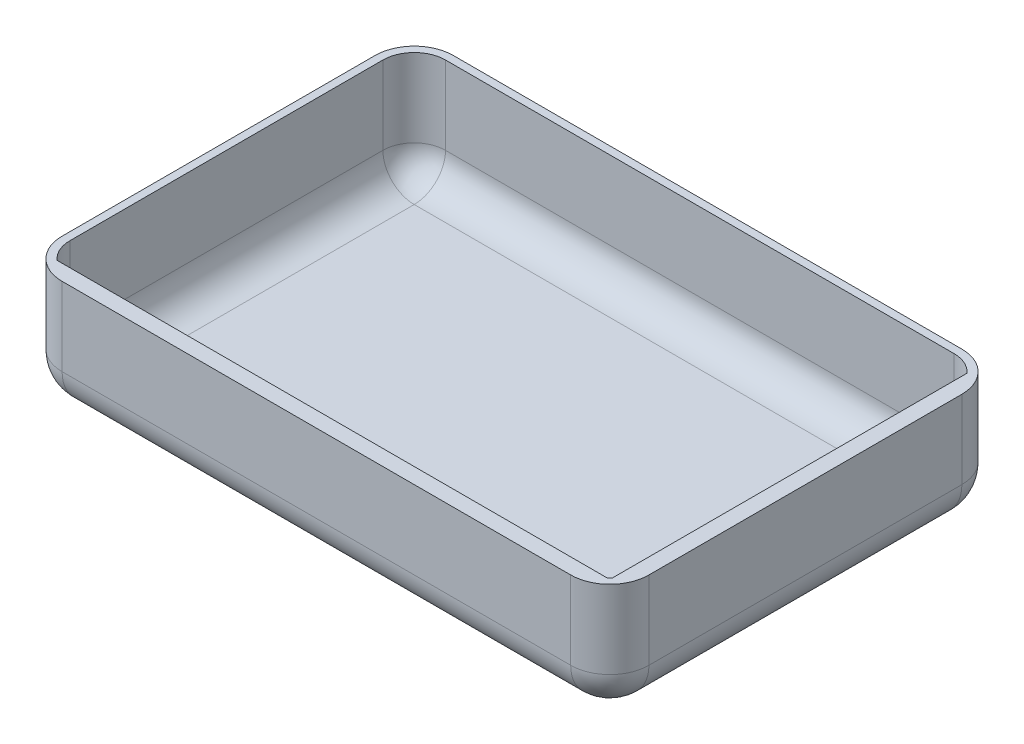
ISO-10303-21;
HEADER;
FILE_DESCRIPTION(('STEP AP214'),'2;1');
FILE_NAME('part.step','',(''),(''),'','','');
FILE_SCHEMA(('AUTOMOTIVE_DESIGN { 1 0 10303 214 1 1 1 1 }'));
ENDSEC;
DATA;
#1=APPLICATION_CONTEXT('core data for automotive mechanical design processes');
#2=APPLICATION_PROTOCOL_DEFINITION('international standard','automotive_design',2000,#1);
#3=PRODUCT_CONTEXT('',#1,'mechanical');
#4=PRODUCT('Part','Part','',(#3));
#5=PRODUCT_RELATED_PRODUCT_CATEGORY('part','',(#4));
#6=PRODUCT_DEFINITION_FORMATION('','',#4);
#7=PRODUCT_DEFINITION_CONTEXT('part definition',#1,'design');
#8=PRODUCT_DEFINITION('design','',#6,#7);
#9=PRODUCT_DEFINITION_SHAPE('','',#8);
#10=(LENGTH_UNIT() NAMED_UNIT(*) SI_UNIT(.MILLI.,.METRE.));
#11=(NAMED_UNIT(*) PLANE_ANGLE_UNIT() SI_UNIT($,.RADIAN.));
#12=(NAMED_UNIT(*) SI_UNIT($,.STERADIAN.) SOLID_ANGLE_UNIT());
#13=UNCERTAINTY_MEASURE_WITH_UNIT(LENGTH_MEASURE(1.E-05),#10,'distance_accuracy_value','');
#14=(GEOMETRIC_REPRESENTATION_CONTEXT(3) GLOBAL_UNCERTAINTY_ASSIGNED_CONTEXT((#13)) GLOBAL_UNIT_ASSIGNED_CONTEXT((#10,
#11,#12)) REPRESENTATION_CONTEXT('',''));
#15=CARTESIAN_POINT('',(0.,0.,0.));
#16=DIRECTION('',(0.,0.,1.));
#17=DIRECTION('',(1.,0.,0.));
#18=AXIS2_PLACEMENT_3D('',#15,#16,#17);
#19=CARTESIAN_POINT('',(-75.,30.,-50.));
#20=DIRECTION('',(1.,0.,0.));
#21=DIRECTION('',(0.,0.,-1.));
#22=AXIS2_PLACEMENT_3D('',#19,#20,#21);
#23=PLANE('',#22);
#24=DIRECTION('',(0.,0.,1.));
#25=VECTOR('',#24,1.);
#26=CARTESIAN_POINT('',(-75.,30.,-50.));
#27=LINE('',#26,#25);
#28=CARTESIAN_POINT('',(-75.,30.,-40.));
#29=VERTEX_POINT('',#28);
#30=CARTESIAN_POINT('',(-75.,30.,40.));
#31=VERTEX_POINT('',#30);
#32=EDGE_CURVE('E305',#29,#31,#27,.T.);
#33=ORIENTED_EDGE('',*,*,#32,.F.);
#34=DIRECTION('',(0.,-1.,0.));
#35=VECTOR('',#34,1.);
#36=CARTESIAN_POINT('',(-75.,30.,-40.));
#37=LINE('',#36,#35);
#38=CARTESIAN_POINT('',(-75.,10.,-40.));
#39=VERTEX_POINT('',#38);
#40=EDGE_CURVE('E59',#29,#39,#37,.T.);
#41=ORIENTED_EDGE('',*,*,#40,.T.);
#42=DIRECTION('',(0.,0.,1.));
#43=VECTOR('',#42,1.);
#44=CARTESIAN_POINT('',(-75.,10.,-50.));
#45=LINE('',#44,#43);
#46=CARTESIAN_POINT('',(-75.,10.,40.));
#47=VERTEX_POINT('',#46);
#48=EDGE_CURVE('E347',#39,#47,#45,.T.);
#49=ORIENTED_EDGE('',*,*,#48,.T.);
#50=DIRECTION('',(0.,-1.,0.));
#51=VECTOR('',#50,1.);
#52=CARTESIAN_POINT('',(-75.,30.,40.));
#53=LINE('',#52,#51);
#54=EDGE_CURVE('E345',#47,#31,#53,.F.);
#55=ORIENTED_EDGE('',*,*,#54,.T.);
#56=EDGE_LOOP('',(#33,#41,#49,#55));
#57=FACE_BOUND('',#56,.T.);
#58=ADVANCED_FACE('F34',(#57),#23,.F.);
#59=CARTESIAN_POINT('',(-75.,30.,50.));
#60=DIRECTION('',(0.,0.,-1.));
#61=DIRECTION('',(-1.,0.,0.));
#62=AXIS2_PLACEMENT_3D('',#59,#60,#61);
#63=PLANE('',#62);
#64=DIRECTION('',(1.,0.,0.));
#65=VECTOR('',#64,1.);
#66=CARTESIAN_POINT('',(-75.,30.,50.));
#67=LINE('',#66,#65);
#68=CARTESIAN_POINT('',(-65.,30.,50.));
#69=VERTEX_POINT('',#68);
#70=CARTESIAN_POINT('',(65.,30.,50.));
#71=VERTEX_POINT('',#70);
#72=EDGE_CURVE('E308',#69,#71,#67,.T.);
#73=ORIENTED_EDGE('',*,*,#72,.F.);
#74=DIRECTION('',(0.,-1.,0.));
#75=VECTOR('',#74,1.);
#76=CARTESIAN_POINT('',(-65.,30.,50.));
#77=LINE('',#76,#75);
#78=CARTESIAN_POINT('',(-65.,10.,50.));
#79=VERTEX_POINT('',#78);
#80=EDGE_CURVE('E322',#69,#79,#77,.T.);
#81=ORIENTED_EDGE('',*,*,#80,.T.);
#82=DIRECTION('',(1.,0.,0.));
#83=VECTOR('',#82,1.);
#84=CARTESIAN_POINT('',(-75.,10.,50.));
#85=LINE('',#84,#83);
#86=CARTESIAN_POINT('',(65.,10.,50.));
#87=VERTEX_POINT('',#86);
#88=EDGE_CURVE('E319',#79,#87,#85,.T.);
#89=ORIENTED_EDGE('',*,*,#88,.T.);
#90=DIRECTION('',(0.,-1.,0.));
#91=VECTOR('',#90,1.);
#92=CARTESIAN_POINT('',(65.,30.,50.));
#93=LINE('',#92,#91);
#94=EDGE_CURVE('E317',#87,#71,#93,.F.);
#95=ORIENTED_EDGE('',*,*,#94,.T.);
#96=EDGE_LOOP('',(#73,#81,#89,#95));
#97=FACE_BOUND('',#96,.T.);
#98=ADVANCED_FACE('F408',(#97),#63,.F.);
#99=CARTESIAN_POINT('',(75.,30.,-50.));
#100=DIRECTION('',(-1.,0.,0.));
#101=DIRECTION('',(0.,0.,1.));
#102=AXIS2_PLACEMENT_3D('',#99,#100,#101);
#103=PLANE('',#102);
#104=DIRECTION('',(0.,0.,-1.));
#105=VECTOR('',#104,1.);
#106=CARTESIAN_POINT('',(75.,10.,-50.));
#107=LINE('',#106,#105);
#108=CARTESIAN_POINT('',(75.,10.,40.));
#109=VERTEX_POINT('',#108);
#110=CARTESIAN_POINT('',(75.,10.,-40.));
#111=VERTEX_POINT('',#110);
#112=EDGE_CURVE('E335',#109,#111,#107,.T.);
#113=ORIENTED_EDGE('',*,*,#112,.T.);
#114=DIRECTION('',(0.,-1.,0.));
#115=VECTOR('',#114,1.);
#116=CARTESIAN_POINT('',(75.,30.,-40.));
#117=LINE('',#116,#115);
#118=CARTESIAN_POINT('',(75.,30.,-40.));
#119=VERTEX_POINT('',#118);
#120=EDGE_CURVE('E337',#111,#119,#117,.F.);
#121=ORIENTED_EDGE('',*,*,#120,.T.);
#122=DIRECTION('',(0.,0.,-1.));
#123=VECTOR('',#122,1.);
#124=CARTESIAN_POINT('',(75.,30.,-50.));
#125=LINE('',#124,#123);
#126=CARTESIAN_POINT('',(75.,30.,40.));
#127=VERTEX_POINT('',#126);
#128=EDGE_CURVE('E311',#127,#119,#125,.T.);
#129=ORIENTED_EDGE('',*,*,#128,.F.);
#130=DIRECTION('',(0.,-1.,0.));
#131=VECTOR('',#130,1.);
#132=CARTESIAN_POINT('',(75.,30.,40.));
#133=LINE('',#132,#131);
#134=EDGE_CURVE('E333',#127,#109,#133,.T.);
#135=ORIENTED_EDGE('',*,*,#134,.T.);
#136=EDGE_LOOP('',(#113,#121,#129,#135));
#137=FACE_BOUND('',#136,.T.);
#138=ADVANCED_FACE('F418',(#137),#103,.F.);
#139=CARTESIAN_POINT('',(-75.,30.,-50.));
#140=DIRECTION('',(0.,0.,1.));
#141=DIRECTION('',(1.,0.,0.));
#142=AXIS2_PLACEMENT_3D('',#139,#140,#141);
#143=PLANE('',#142);
#144=DIRECTION('',(-1.,0.,0.));
#145=VECTOR('',#144,1.);
#146=CARTESIAN_POINT('',(-75.,10.,-50.));
#147=LINE('',#146,#145);
#148=CARTESIAN_POINT('',(65.,10.,-50.));
#149=VERTEX_POINT('',#148);
#150=CARTESIAN_POINT('',(-65.,10.,-50.));
#151=VERTEX_POINT('',#150);
#152=EDGE_CURVE('E341',#149,#151,#147,.T.);
#153=ORIENTED_EDGE('',*,*,#152,.T.);
#154=DIRECTION('',(0.,-1.,0.));
#155=VECTOR('',#154,1.);
#156=CARTESIAN_POINT('',(-65.,30.,-50.));
#157=LINE('',#156,#155);
#158=CARTESIAN_POINT('',(-65.,30.,-50.));
#159=VERTEX_POINT('',#158);
#160=EDGE_CURVE('E343',#151,#159,#157,.F.);
#161=ORIENTED_EDGE('',*,*,#160,.T.);
#162=DIRECTION('',(-1.,0.,0.));
#163=VECTOR('',#162,1.);
#164=CARTESIAN_POINT('',(-75.,30.,-50.));
#165=LINE('',#164,#163);
#166=CARTESIAN_POINT('',(65.,30.,-50.));
#167=VERTEX_POINT('',#166);
#168=EDGE_CURVE('E314',#167,#159,#165,.T.);
#169=ORIENTED_EDGE('',*,*,#168,.F.);
#170=DIRECTION('',(0.,-1.,0.));
#171=VECTOR('',#170,1.);
#172=CARTESIAN_POINT('',(65.,30.,-50.));
#173=LINE('',#172,#171);
#174=EDGE_CURVE('E339',#167,#149,#173,.T.);
#175=ORIENTED_EDGE('',*,*,#174,.T.);
#176=EDGE_LOOP('',(#153,#161,#169,#175));
#177=FACE_BOUND('',#176,.T.);
#178=ADVANCED_FACE('F439',(#177),#143,.F.);
#179=CARTESIAN_POINT('',(-75.,30.,50.));
#180=DIRECTION('',(0.,1.,0.));
#181=DIRECTION('',(0.,0.,1.));
#182=AXIS2_PLACEMENT_3D('',#179,#180,#181);
#183=PLANE('',#182);
#184=DIRECTION('',(-1.,0.,0.));
#185=VECTOR('',#184,1.);
#186=CARTESIAN_POINT('',(-75.,30.,-48.));
#187=LINE('',#186,#185);
#188=CARTESIAN_POINT('',(65.,30.,-48.));
#189=VERTEX_POINT('',#188);
#190=CARTESIAN_POINT('',(-65.,30.,-48.));
#191=VERTEX_POINT('',#190);
#192=EDGE_CURVE('E265',#189,#191,#187,.T.);
#193=ORIENTED_EDGE('',*,*,#192,.F.);
#194=CARTESIAN_POINT('',(65.,30.,-40.));
#195=DIRECTION('',(0.,1.,0.));
#196=DIRECTION('',(0.,0.,1.));
#197=AXIS2_PLACEMENT_3D('',#194,#195,#196);
#198=CIRCLE('',#197,8.);
#199=CARTESIAN_POINT('',(71.,30.,-45.2915026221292));
#200=VERTEX_POINT('',#199);
#201=EDGE_CURVE('E293',#200,#189,#198,.T.);
#202=ORIENTED_EDGE('',*,*,#201,.F.);
#203=DIRECTION('',(0.,0.,-1.));
#204=VECTOR('',#203,1.);
#205=CARTESIAN_POINT('',(71.,30.,-50.));
#206=LINE('',#205,#204);
#207=CARTESIAN_POINT('',(71.,30.,45.2915026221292));
#208=VERTEX_POINT('',#207);
#209=EDGE_CURVE('E51',#208,#200,#206,.T.);
#210=ORIENTED_EDGE('',*,*,#209,.F.);
#211=CARTESIAN_POINT('',(65.,30.,40.));
#212=DIRECTION('',(0.,1.,0.));
#213=DIRECTION('',(0.,0.,1.));
#214=AXIS2_PLACEMENT_3D('',#211,#212,#213);
#215=CIRCLE('',#214,8.);
#216=CARTESIAN_POINT('',(70.2915026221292,30.,46.));
#217=VERTEX_POINT('',#216);
#218=EDGE_CURVE('E197',#217,#208,#215,.T.);
#219=ORIENTED_EDGE('',*,*,#218,.F.);
#220=DIRECTION('',(1.,0.,0.));
#221=VECTOR('',#220,1.);
#222=CARTESIAN_POINT('',(-75.,30.,46.));
#223=LINE('',#222,#221);
#224=CARTESIAN_POINT('',(-70.2915026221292,30.,46.));
#225=VERTEX_POINT('',#224);
#226=EDGE_CURVE('E290',#225,#217,#223,.T.);
#227=ORIENTED_EDGE('',*,*,#226,.F.);
#228=CARTESIAN_POINT('',(-65.,30.,40.));
#229=DIRECTION('',(0.,1.,0.));
#230=DIRECTION('',(0.,0.,1.));
#231=AXIS2_PLACEMENT_3D('',#228,#229,#230);
#232=CIRCLE('',#231,8.);
#233=CARTESIAN_POINT('',(-73.,30.,40.));
#234=VERTEX_POINT('',#233);
#235=EDGE_CURVE('E291',#234,#225,#232,.T.);
#236=ORIENTED_EDGE('',*,*,#235,.F.);
#237=DIRECTION('',(0.,0.,1.));
#238=VECTOR('',#237,1.);
#239=CARTESIAN_POINT('',(-73.,30.,-50.));
#240=LINE('',#239,#238);
#241=CARTESIAN_POINT('',(-73.,30.,-40.));
#242=VERTEX_POINT('',#241);
#243=EDGE_CURVE('E254',#242,#234,#240,.T.);
#244=ORIENTED_EDGE('',*,*,#243,.F.);
#245=CARTESIAN_POINT('',(-65.,30.,-40.));
#246=DIRECTION('',(0.,1.,0.));
#247=DIRECTION('',(0.,0.,1.));
#248=AXIS2_PLACEMENT_3D('',#245,#246,#247);
#249=CIRCLE('',#248,8.);
#250=EDGE_CURVE('E192',#191,#242,#249,.T.);
#251=ORIENTED_EDGE('',*,*,#250,.F.);
#252=EDGE_LOOP('',(#193,#202,#210,#219,#227,#236,#244,#251));
#253=FACE_BOUND('',#252,.T.);
#254=ORIENTED_EDGE('',*,*,#168,.T.);
#255=CARTESIAN_POINT('',(-65.,30.,-40.));
#256=DIRECTION('',(0.,1.,0.));
#257=DIRECTION('',(0.,0.,1.));
#258=AXIS2_PLACEMENT_3D('',#255,#256,#257);
#259=CIRCLE('',#258,10.);
#260=EDGE_CURVE('E11',#159,#29,#259,.T.);
#261=ORIENTED_EDGE('',*,*,#260,.T.);
#262=ORIENTED_EDGE('',*,*,#32,.T.);
#263=CARTESIAN_POINT('',(-65.,30.,40.));
#264=DIRECTION('',(0.,1.,0.));
#265=DIRECTION('',(0.,0.,1.));
#266=AXIS2_PLACEMENT_3D('',#263,#264,#265);
#267=CIRCLE('',#266,10.);
#268=EDGE_CURVE('E43',#31,#69,#267,.T.);
#269=ORIENTED_EDGE('',*,*,#268,.T.);
#270=ORIENTED_EDGE('',*,*,#72,.T.);
#271=CARTESIAN_POINT('',(65.,30.,40.));
#272=DIRECTION('',(0.,1.,0.));
#273=DIRECTION('',(0.,0.,1.));
#274=AXIS2_PLACEMENT_3D('',#271,#272,#273);
#275=CIRCLE('',#274,10.);
#276=EDGE_CURVE('E350',#71,#127,#275,.T.);
#277=ORIENTED_EDGE('',*,*,#276,.T.);
#278=ORIENTED_EDGE('',*,*,#128,.T.);
#279=CARTESIAN_POINT('',(65.,30.,-40.));
#280=DIRECTION('',(0.,1.,0.));
#281=DIRECTION('',(0.,0.,1.));
#282=AXIS2_PLACEMENT_3D('',#279,#280,#281);
#283=CIRCLE('',#282,10.);
#284=EDGE_CURVE('E352',#119,#167,#283,.T.);
#285=ORIENTED_EDGE('',*,*,#284,.T.);
#286=EDGE_LOOP('',(#254,#261,#262,#269,#270,#277,#278,#285));
#287=FACE_BOUND('',#286,.T.);
#288=ADVANCED_FACE('F405',(#253,#287),#183,.T.);
#289=CARTESIAN_POINT('',(-75.,0.,50.));
#290=DIRECTION('',(0.,1.,0.));
#291=DIRECTION('',(0.,0.,1.));
#292=AXIS2_PLACEMENT_3D('',#289,#290,#291);
#293=PLANE('',#292);
#294=DIRECTION('',(0.,0.,-1.));
#295=VECTOR('',#294,1.);
#296=CARTESIAN_POINT('',(65.,0.,50.));
#297=LINE('',#296,#295);
#298=CARTESIAN_POINT('',(65.,0.,-40.));
#299=VERTEX_POINT('',#298);
#300=CARTESIAN_POINT('',(65.,0.,40.));
#301=VERTEX_POINT('',#300);
#302=EDGE_CURVE('E328',#299,#301,#297,.F.);
#303=ORIENTED_EDGE('',*,*,#302,.T.);
#304=DIRECTION('',(1.,0.,0.));
#305=VECTOR('',#304,1.);
#306=CARTESIAN_POINT('',(-75.,0.,40.));
#307=LINE('',#306,#305);
#308=CARTESIAN_POINT('',(-65.,0.,40.));
#309=VERTEX_POINT('',#308);
#310=EDGE_CURVE('E330',#301,#309,#307,.F.);
#311=ORIENTED_EDGE('',*,*,#310,.T.);
#312=DIRECTION('',(0.,0.,1.));
#313=VECTOR('',#312,1.);
#314=CARTESIAN_POINT('',(-65.,0.,50.));
#315=LINE('',#314,#313);
#316=CARTESIAN_POINT('',(-65.,0.,-40.));
#317=VERTEX_POINT('',#316);
#318=EDGE_CURVE('E324',#309,#317,#315,.F.);
#319=ORIENTED_EDGE('',*,*,#318,.T.);
#320=DIRECTION('',(-1.,0.,0.));
#321=VECTOR('',#320,1.);
#322=CARTESIAN_POINT('',(-75.,0.,-40.));
#323=LINE('',#322,#321);
#324=EDGE_CURVE('E326',#317,#299,#323,.F.);
#325=ORIENTED_EDGE('',*,*,#324,.T.);
#326=EDGE_LOOP('',(#303,#311,#319,#325));
#327=FACE_BOUND('',#326,.T.);
#328=ADVANCED_FACE('F435',(#327),#293,.F.);
#329=CARTESIAN_POINT('',(-65.,30.,-40.));
#330=DIRECTION('',(0.,-1.,0.));
#331=DIRECTION('',(0.,0.,-1.));
#332=AXIS2_PLACEMENT_3D('',#329,#330,#331);
#333=CYLINDRICAL_SURFACE('',#332,10.);
#334=ORIENTED_EDGE('',*,*,#260,.F.);
#335=ORIENTED_EDGE('',*,*,#160,.F.);
#336=CARTESIAN_POINT('',(-65.,10.,-40.));
#337=DIRECTION('',(0.,-1.,0.));
#338=DIRECTION('',(0.,0.,-1.));
#339=AXIS2_PLACEMENT_3D('',#336,#337,#338);
#340=CIRCLE('',#339,10.);
#341=EDGE_CURVE('E381',#39,#151,#340,.T.);
#342=ORIENTED_EDGE('',*,*,#341,.F.);
#343=ORIENTED_EDGE('',*,*,#40,.F.);
#344=EDGE_LOOP('',(#334,#335,#342,#343));
#345=FACE_BOUND('',#344,.T.);
#346=ADVANCED_FACE('F36',(#345),#333,.T.);
#347=CARTESIAN_POINT('',(65.,30.,-40.));
#348=DIRECTION('',(0.,-1.,0.));
#349=DIRECTION('',(0.,0.,-1.));
#350=AXIS2_PLACEMENT_3D('',#347,#348,#349);
#351=CYLINDRICAL_SURFACE('',#350,10.);
#352=ORIENTED_EDGE('',*,*,#284,.F.);
#353=ORIENTED_EDGE('',*,*,#120,.F.);
#354=CARTESIAN_POINT('',(65.,10.,-40.));
#355=DIRECTION('',(0.,-1.,0.));
#356=DIRECTION('',(0.,0.,-1.));
#357=AXIS2_PLACEMENT_3D('',#354,#355,#356);
#358=CIRCLE('',#357,10.);
#359=EDGE_CURVE('E379',#149,#111,#358,.T.);
#360=ORIENTED_EDGE('',*,*,#359,.F.);
#361=ORIENTED_EDGE('',*,*,#174,.F.);
#362=EDGE_LOOP('',(#352,#353,#360,#361));
#363=FACE_BOUND('',#362,.T.);
#364=ADVANCED_FACE('F423',(#363),#351,.T.);
#365=CARTESIAN_POINT('',(-75.,10.,-40.));
#366=DIRECTION('',(-1.,0.,0.));
#367=DIRECTION('',(0.,0.,1.));
#368=AXIS2_PLACEMENT_3D('',#365,#366,#367);
#369=CYLINDRICAL_SURFACE('',#368,10.);
#370=CARTESIAN_POINT('',(-65.,10.,-40.));
#371=DIRECTION('',(-1.,0.,0.));
#372=DIRECTION('',(0.,0.,1.));
#373=AXIS2_PLACEMENT_3D('',#370,#371,#372);
#374=CIRCLE('',#373,10.);
#375=EDGE_CURVE('E38',#151,#317,#374,.T.);
#376=ORIENTED_EDGE('',*,*,#375,.F.);
#377=ORIENTED_EDGE('',*,*,#152,.F.);
#378=CARTESIAN_POINT('',(65.,10.,-40.));
#379=DIRECTION('',(1.,0.,0.));
#380=DIRECTION('',(0.,0.,-1.));
#381=AXIS2_PLACEMENT_3D('',#378,#379,#380);
#382=CIRCLE('',#381,10.);
#383=EDGE_CURVE('E376',#299,#149,#382,.T.);
#384=ORIENTED_EDGE('',*,*,#383,.F.);
#385=ORIENTED_EDGE('',*,*,#324,.F.);
#386=EDGE_LOOP('',(#376,#377,#384,#385));
#387=FACE_BOUND('',#386,.T.);
#388=ADVANCED_FACE('F436',(#387),#369,.T.);
#389=CARTESIAN_POINT('',(-65.,10.,-40.));
#390=DIRECTION('',(0.,0.,1.));
#391=DIRECTION('',(1.,0.,0.));
#392=AXIS2_PLACEMENT_3D('',#389,#390,#391);
#393=SPHERICAL_SURFACE('',#392,10.);
#394=ORIENTED_EDGE('',*,*,#341,.T.);
#395=ORIENTED_EDGE('',*,*,#375,.T.);
#396=CARTESIAN_POINT('',(-65.,10.,-40.));
#397=DIRECTION('',(0.,0.,-1.));
#398=DIRECTION('',(-1.,0.,0.));
#399=AXIS2_PLACEMENT_3D('',#396,#397,#398);
#400=CIRCLE('',#399,10.);
#401=EDGE_CURVE('E373',#39,#317,#400,.F.);
#402=ORIENTED_EDGE('',*,*,#401,.F.);
#403=EDGE_LOOP('',(#394,#395,#402));
#404=FACE_BOUND('',#403,.T.);
#405=ADVANCED_FACE('F387',(#404),#393,.T.);
#406=CARTESIAN_POINT('',(65.,10.,-40.));
#407=DIRECTION('',(0.,0.,1.));
#408=DIRECTION('',(1.,0.,0.));
#409=AXIS2_PLACEMENT_3D('',#406,#407,#408);
#410=SPHERICAL_SURFACE('',#409,10.);
#411=ORIENTED_EDGE('',*,*,#383,.T.);
#412=ORIENTED_EDGE('',*,*,#359,.T.);
#413=CARTESIAN_POINT('',(65.,10.,-40.));
#414=DIRECTION('',(0.,0.,-1.));
#415=DIRECTION('',(-1.,0.,0.));
#416=AXIS2_PLACEMENT_3D('',#413,#414,#415);
#417=CIRCLE('',#416,10.);
#418=EDGE_CURVE('E370',#299,#111,#417,.F.);
#419=ORIENTED_EDGE('',*,*,#418,.F.);
#420=EDGE_LOOP('',(#411,#412,#419));
#421=FACE_BOUND('',#420,.T.);
#422=ADVANCED_FACE('F427',(#421),#410,.T.);
#423=CARTESIAN_POINT('',(-65.,10.,-50.));
#424=DIRECTION('',(0.,0.,1.));
#425=DIRECTION('',(1.,0.,0.));
#426=AXIS2_PLACEMENT_3D('',#423,#424,#425);
#427=CYLINDRICAL_SURFACE('',#426,10.);
#428=ORIENTED_EDGE('',*,*,#401,.T.);
#429=ORIENTED_EDGE('',*,*,#318,.F.);
#430=CARTESIAN_POINT('',(-65.,10.,40.));
#431=DIRECTION('',(0.,0.,1.));
#432=DIRECTION('',(1.,0.,0.));
#433=AXIS2_PLACEMENT_3D('',#430,#431,#432);
#434=CIRCLE('',#433,10.);
#435=EDGE_CURVE('E367',#47,#309,#434,.T.);
#436=ORIENTED_EDGE('',*,*,#435,.F.);
#437=ORIENTED_EDGE('',*,*,#48,.F.);
#438=EDGE_LOOP('',(#428,#429,#436,#437));
#439=FACE_BOUND('',#438,.T.);
#440=ADVANCED_FACE('F394',(#439),#427,.T.);
#441=CARTESIAN_POINT('',(-65.,30.,40.));
#442=DIRECTION('',(0.,-1.,0.));
#443=DIRECTION('',(0.,0.,-1.));
#444=AXIS2_PLACEMENT_3D('',#441,#442,#443);
#445=CYLINDRICAL_SURFACE('',#444,10.);
#446=ORIENTED_EDGE('',*,*,#268,.F.);
#447=ORIENTED_EDGE('',*,*,#54,.F.);
#448=CARTESIAN_POINT('',(-65.,10.,40.));
#449=DIRECTION('',(0.,-1.,0.));
#450=DIRECTION('',(0.,0.,-1.));
#451=AXIS2_PLACEMENT_3D('',#448,#449,#450);
#452=CIRCLE('',#451,10.);
#453=EDGE_CURVE('E364',#79,#47,#452,.T.);
#454=ORIENTED_EDGE('',*,*,#453,.F.);
#455=ORIENTED_EDGE('',*,*,#80,.F.);
#456=EDGE_LOOP('',(#446,#447,#454,#455));
#457=FACE_BOUND('',#456,.T.);
#458=ADVANCED_FACE('F400',(#457),#445,.T.);
#459=CARTESIAN_POINT('',(65.,30.,40.));
#460=DIRECTION('',(0.,-1.,0.));
#461=DIRECTION('',(0.,0.,-1.));
#462=AXIS2_PLACEMENT_3D('',#459,#460,#461);
#463=CYLINDRICAL_SURFACE('',#462,10.);
#464=ORIENTED_EDGE('',*,*,#276,.F.);
#465=ORIENTED_EDGE('',*,*,#94,.F.);
#466=CARTESIAN_POINT('',(65.,10.,40.));
#467=DIRECTION('',(0.,-1.,0.));
#468=DIRECTION('',(0.,0.,-1.));
#469=AXIS2_PLACEMENT_3D('',#466,#467,#468);
#470=CIRCLE('',#469,10.);
#471=EDGE_CURVE('E361',#109,#87,#470,.T.);
#472=ORIENTED_EDGE('',*,*,#471,.F.);
#473=ORIENTED_EDGE('',*,*,#134,.F.);
#474=EDGE_LOOP('',(#464,#465,#472,#473));
#475=FACE_BOUND('',#474,.T.);
#476=ADVANCED_FACE('F413',(#475),#463,.T.);
#477=CARTESIAN_POINT('',(65.,10.,-50.));
#478=DIRECTION('',(0.,0.,-1.));
#479=DIRECTION('',(-1.,0.,0.));
#480=AXIS2_PLACEMENT_3D('',#477,#478,#479);
#481=CYLINDRICAL_SURFACE('',#480,10.);
#482=ORIENTED_EDGE('',*,*,#418,.T.);
#483=ORIENTED_EDGE('',*,*,#112,.F.);
#484=CARTESIAN_POINT('',(65.,10.,40.));
#485=DIRECTION('',(0.,0.,1.));
#486=DIRECTION('',(1.,0.,0.));
#487=AXIS2_PLACEMENT_3D('',#484,#485,#486);
#488=CIRCLE('',#487,10.);
#489=EDGE_CURVE('E358',#301,#109,#488,.T.);
#490=ORIENTED_EDGE('',*,*,#489,.F.);
#491=ORIENTED_EDGE('',*,*,#302,.F.);
#492=EDGE_LOOP('',(#482,#483,#490,#491));
#493=FACE_BOUND('',#492,.T.);
#494=ADVANCED_FACE('F431',(#493),#481,.T.);
#495=CARTESIAN_POINT('',(-65.,10.,40.));
#496=DIRECTION('',(0.,0.,1.));
#497=DIRECTION('',(1.,0.,0.));
#498=AXIS2_PLACEMENT_3D('',#495,#496,#497);
#499=SPHERICAL_SURFACE('',#498,10.);
#500=ORIENTED_EDGE('',*,*,#453,.T.);
#501=ORIENTED_EDGE('',*,*,#435,.T.);
#502=CARTESIAN_POINT('',(-65.,10.,40.));
#503=DIRECTION('',(-1.,0.,0.));
#504=DIRECTION('',(0.,0.,1.));
#505=AXIS2_PLACEMENT_3D('',#502,#503,#504);
#506=CIRCLE('',#505,10.);
#507=EDGE_CURVE('E356',#79,#309,#506,.F.);
#508=ORIENTED_EDGE('',*,*,#507,.F.);
#509=EDGE_LOOP('',(#500,#501,#508));
#510=FACE_BOUND('',#509,.T.);
#511=ADVANCED_FACE('F464',(#510),#499,.T.);
#512=CARTESIAN_POINT('',(65.,10.,40.));
#513=DIRECTION('',(0.,0.,1.));
#514=DIRECTION('',(1.,0.,0.));
#515=AXIS2_PLACEMENT_3D('',#512,#513,#514);
#516=SPHERICAL_SURFACE('',#515,10.);
#517=ORIENTED_EDGE('',*,*,#489,.T.);
#518=ORIENTED_EDGE('',*,*,#471,.T.);
#519=CARTESIAN_POINT('',(65.,10.,40.));
#520=DIRECTION('',(1.,0.,0.));
#521=DIRECTION('',(0.,0.,-1.));
#522=AXIS2_PLACEMENT_3D('',#519,#520,#521);
#523=CIRCLE('',#522,10.);
#524=EDGE_CURVE('E288',#301,#87,#523,.F.);
#525=ORIENTED_EDGE('',*,*,#524,.F.);
#526=EDGE_LOOP('',(#517,#518,#525));
#527=FACE_BOUND('',#526,.T.);
#528=ADVANCED_FACE('F460',(#527),#516,.T.);
#529=CARTESIAN_POINT('',(-75.,10.,40.));
#530=DIRECTION('',(1.,0.,0.));
#531=DIRECTION('',(0.,0.,-1.));
#532=AXIS2_PLACEMENT_3D('',#529,#530,#531);
#533=CYLINDRICAL_SURFACE('',#532,10.);
#534=ORIENTED_EDGE('',*,*,#507,.T.);
#535=ORIENTED_EDGE('',*,*,#310,.F.);
#536=ORIENTED_EDGE('',*,*,#524,.T.);
#537=ORIENTED_EDGE('',*,*,#88,.F.);
#538=EDGE_LOOP('',(#534,#535,#536,#537));
#539=FACE_BOUND('',#538,.T.);
#540=ADVANCED_FACE('F457',(#539),#533,.T.);
#541=CARTESIAN_POINT('',(-73.,30.,-50.));
#542=DIRECTION('',(1.,0.,0.));
#543=DIRECTION('',(0.,0.,-1.));
#544=AXIS2_PLACEMENT_3D('',#541,#542,#543);
#545=PLANE('',#544);
#546=ORIENTED_EDGE('',*,*,#243,.T.);
#547=DIRECTION('',(0.,1.,0.));
#548=VECTOR('',#547,1.);
#549=CARTESIAN_POINT('',(-73.,30.,40.));
#550=LINE('',#549,#548);
#551=CARTESIAN_POINT('',(-73.,10.,40.));
#552=VERTEX_POINT('',#551);
#553=EDGE_CURVE('E221',#552,#234,#550,.T.);
#554=ORIENTED_EDGE('',*,*,#553,.F.);
#555=DIRECTION('',(0.,0.,-1.));
#556=VECTOR('',#555,1.);
#557=CARTESIAN_POINT('',(-73.,10.,-50.));
#558=LINE('',#557,#556);
#559=CARTESIAN_POINT('',(-73.,10.,-40.));
#560=VERTEX_POINT('',#559);
#561=EDGE_CURVE('E198',#560,#552,#558,.F.);
#562=ORIENTED_EDGE('',*,*,#561,.F.);
#563=DIRECTION('',(0.,1.,0.));
#564=VECTOR('',#563,1.);
#565=CARTESIAN_POINT('',(-73.,30.,-40.));
#566=LINE('',#565,#564);
#567=EDGE_CURVE('E187',#242,#560,#566,.F.);
#568=ORIENTED_EDGE('',*,*,#567,.F.);
#569=EDGE_LOOP('',(#546,#554,#562,#568));
#570=FACE_BOUND('',#569,.T.);
#571=ADVANCED_FACE('F220',(#570),#545,.T.);
#572=CARTESIAN_POINT('',(-75.,30.,46.));
#573=DIRECTION('',(0.,0.,-1.));
#574=DIRECTION('',(-1.,0.,0.));
#575=AXIS2_PLACEMENT_3D('',#572,#573,#574);
#576=PLANE('',#575);
#577=ORIENTED_EDGE('',*,*,#226,.T.);
#578=DIRECTION('',(0.,-1.,0.));
#579=VECTOR('',#578,1.);
#580=CARTESIAN_POINT('',(70.2915026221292,30.,46.));
#581=LINE('',#580,#579);
#582=CARTESIAN_POINT('',(70.2915026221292,15.2915026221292,46.));
#583=VERTEX_POINT('',#582);
#584=EDGE_CURVE('E263',#583,#217,#581,.F.);
#585=ORIENTED_EDGE('',*,*,#584,.F.);
#586=DIRECTION('',(1.,0.,0.));
#587=VECTOR('',#586,1.);
#588=CARTESIAN_POINT('',(-75.,15.2915026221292,46.));
#589=LINE('',#588,#587);
#590=CARTESIAN_POINT('',(-65.,15.2915026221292,46.));
#591=VERTEX_POINT('',#590);
#592=EDGE_CURVE('E262',#591,#583,#589,.T.);
#593=ORIENTED_EDGE('',*,*,#592,.F.);
#594=CARTESIAN_POINT('',(-65.,10.,46.));
#595=DIRECTION('',(0.,0.,-1.));
#596=DIRECTION('',(-1.,0.,0.));
#597=AXIS2_PLACEMENT_3D('',#594,#595,#596);
#598=CIRCLE('',#597,5.29150262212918);
#599=CARTESIAN_POINT('',(-70.2915026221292,10.,46.));
#600=VERTEX_POINT('',#599);
#601=EDGE_CURVE('E282',#591,#600,#598,.F.);
#602=ORIENTED_EDGE('',*,*,#601,.T.);
#603=DIRECTION('',(0.,-1.,0.));
#604=VECTOR('',#603,1.);
#605=CARTESIAN_POINT('',(-70.2915026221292,30.,46.));
#606=LINE('',#605,#604);
#607=EDGE_CURVE('E252',#225,#600,#606,.T.);
#608=ORIENTED_EDGE('',*,*,#607,.F.);
#609=EDGE_LOOP('',(#577,#585,#593,#602,#608));
#610=FACE_BOUND('',#609,.T.);
#611=ADVANCED_FACE('F531',(#610),#576,.T.);
#612=CARTESIAN_POINT('',(71.,30.,-50.));
#613=DIRECTION('',(-1.,0.,0.));
#614=DIRECTION('',(0.,0.,1.));
#615=AXIS2_PLACEMENT_3D('',#612,#613,#614);
#616=PLANE('',#615);
#617=DIRECTION('',(0.,0.,-1.));
#618=VECTOR('',#617,1.);
#619=CARTESIAN_POINT('',(71.,15.2915026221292,-50.));
#620=LINE('',#619,#618);
#621=CARTESIAN_POINT('',(71.,15.2915026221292,45.2915026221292));
#622=VERTEX_POINT('',#621);
#623=CARTESIAN_POINT('',(71.,15.2915026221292,-40.));
#624=VERTEX_POINT('',#623);
#625=EDGE_CURVE('E234',#622,#624,#620,.T.);
#626=ORIENTED_EDGE('',*,*,#625,.F.);
#627=DIRECTION('',(0.,-1.,0.));
#628=VECTOR('',#627,1.);
#629=CARTESIAN_POINT('',(71.,30.,45.2915026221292));
#630=LINE('',#629,#628);
#631=EDGE_CURVE('E237',#208,#622,#630,.T.);
#632=ORIENTED_EDGE('',*,*,#631,.F.);
#633=ORIENTED_EDGE('',*,*,#209,.T.);
#634=DIRECTION('',(0.,-1.,0.));
#635=VECTOR('',#634,1.);
#636=CARTESIAN_POINT('',(71.,30.,-45.2915026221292));
#637=LINE('',#636,#635);
#638=CARTESIAN_POINT('',(71.,10.,-45.2915026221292));
#639=VERTEX_POINT('',#638);
#640=EDGE_CURVE('E232',#639,#200,#637,.F.);
#641=ORIENTED_EDGE('',*,*,#640,.F.);
#642=CARTESIAN_POINT('',(71.,10.,-40.));
#643=DIRECTION('',(-1.,0.,0.));
#644=DIRECTION('',(0.,0.,1.));
#645=AXIS2_PLACEMENT_3D('',#642,#643,#644);
#646=CIRCLE('',#645,5.29150262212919);
#647=EDGE_CURVE('E276',#639,#624,#646,.F.);
#648=ORIENTED_EDGE('',*,*,#647,.T.);
#649=EDGE_LOOP('',(#626,#632,#633,#641,#648));
#650=FACE_BOUND('',#649,.T.);
#651=ADVANCED_FACE('F538',(#650),#616,.T.);
#652=CARTESIAN_POINT('',(-75.,30.,-48.));
#653=DIRECTION('',(0.,0.,1.));
#654=DIRECTION('',(1.,0.,0.));
#655=AXIS2_PLACEMENT_3D('',#652,#653,#654);
#656=PLANE('',#655);
#657=DIRECTION('',(1.,0.,0.));
#658=VECTOR('',#657,1.);
#659=CARTESIAN_POINT('',(-75.,10.,-48.));
#660=LINE('',#659,#658);
#661=CARTESIAN_POINT('',(65.,10.,-48.));
#662=VERTEX_POINT('',#661);
#663=CARTESIAN_POINT('',(-65.,10.,-48.));
#664=VERTEX_POINT('',#663);
#665=EDGE_CURVE('E227',#662,#664,#660,.F.);
#666=ORIENTED_EDGE('',*,*,#665,.F.);
#667=DIRECTION('',(0.,1.,0.));
#668=VECTOR('',#667,1.);
#669=CARTESIAN_POINT('',(65.,30.,-48.));
#670=LINE('',#669,#668);
#671=EDGE_CURVE('E230',#189,#662,#670,.F.);
#672=ORIENTED_EDGE('',*,*,#671,.F.);
#673=ORIENTED_EDGE('',*,*,#192,.T.);
#674=DIRECTION('',(0.,1.,0.));
#675=VECTOR('',#674,1.);
#676=CARTESIAN_POINT('',(-65.,30.,-48.));
#677=LINE('',#676,#675);
#678=EDGE_CURVE('E224',#664,#191,#677,.T.);
#679=ORIENTED_EDGE('',*,*,#678,.F.);
#680=EDGE_LOOP('',(#666,#672,#673,#679));
#681=FACE_BOUND('',#680,.T.);
#682=ADVANCED_FACE('F546',(#681),#656,.T.);
#683=CARTESIAN_POINT('',(-75.,2.,50.));
#684=DIRECTION('',(0.,1.,0.));
#685=DIRECTION('',(0.,0.,1.));
#686=AXIS2_PLACEMENT_3D('',#683,#684,#685);
#687=PLANE('',#686);
#688=DIRECTION('',(0.,0.,1.));
#689=VECTOR('',#688,1.);
#690=CARTESIAN_POINT('',(65.,2.,50.));
#691=LINE('',#690,#689);
#692=CARTESIAN_POINT('',(65.,2.,-40.));
#693=VERTEX_POINT('',#692);
#694=CARTESIAN_POINT('',(65.,2.,40.));
#695=VERTEX_POINT('',#694);
#696=EDGE_CURVE('E246',#693,#695,#691,.T.);
#697=ORIENTED_EDGE('',*,*,#696,.F.);
#698=DIRECTION('',(1.,0.,0.));
#699=VECTOR('',#698,1.);
#700=CARTESIAN_POINT('',(-75.,2.,-40.));
#701=LINE('',#700,#699);
#702=CARTESIAN_POINT('',(-65.,2.,-40.));
#703=VERTEX_POINT('',#702);
#704=EDGE_CURVE('E248',#703,#693,#701,.T.);
#705=ORIENTED_EDGE('',*,*,#704,.F.);
#706=DIRECTION('',(0.,0.,1.));
#707=VECTOR('',#706,1.);
#708=CARTESIAN_POINT('',(-65.,2.,50.));
#709=LINE('',#708,#707);
#710=CARTESIAN_POINT('',(-65.,2.,40.));
#711=VERTEX_POINT('',#710);
#712=EDGE_CURVE('E215',#711,#703,#709,.F.);
#713=ORIENTED_EDGE('',*,*,#712,.F.);
#714=DIRECTION('',(1.,0.,0.));
#715=VECTOR('',#714,1.);
#716=CARTESIAN_POINT('',(-75.,2.,40.));
#717=LINE('',#716,#715);
#718=EDGE_CURVE('E240',#695,#711,#717,.F.);
#719=ORIENTED_EDGE('',*,*,#718,.F.);
#720=EDGE_LOOP('',(#697,#705,#713,#719));
#721=FACE_BOUND('',#720,.T.);
#722=ADVANCED_FACE('F553',(#721),#687,.T.);
#723=CARTESIAN_POINT('',(-65.,30.,-40.));
#724=DIRECTION('',(0.,-1.,0.));
#725=DIRECTION('',(0.,0.,-1.));
#726=AXIS2_PLACEMENT_3D('',#723,#724,#725);
#727=CYLINDRICAL_SURFACE('',#726,8.);
#728=ORIENTED_EDGE('',*,*,#250,.T.);
#729=ORIENTED_EDGE('',*,*,#567,.T.);
#730=CARTESIAN_POINT('',(-65.,10.,-40.));
#731=DIRECTION('',(0.,1.,0.));
#732=DIRECTION('',(-1.,0.,0.));
#733=AXIS2_PLACEMENT_3D('',#730,#731,#732);
#734=CIRCLE('',#733,8.);
#735=EDGE_CURVE('E190',#560,#664,#734,.F.);
#736=ORIENTED_EDGE('',*,*,#735,.T.);
#737=ORIENTED_EDGE('',*,*,#678,.T.);
#738=EDGE_LOOP('',(#728,#729,#736,#737));
#739=FACE_BOUND('',#738,.T.);
#740=ADVANCED_FACE('F189',(#739),#727,.F.);
#741=CARTESIAN_POINT('',(65.,30.,-40.));
#742=DIRECTION('',(0.,-1.,0.));
#743=DIRECTION('',(0.,0.,-1.));
#744=AXIS2_PLACEMENT_3D('',#741,#742,#743);
#745=CYLINDRICAL_SURFACE('',#744,8.);
#746=ORIENTED_EDGE('',*,*,#201,.T.);
#747=ORIENTED_EDGE('',*,*,#671,.T.);
#748=CARTESIAN_POINT('',(65.,10.,-40.));
#749=DIRECTION('',(0.,-1.,0.));
#750=DIRECTION('',(1.,0.,0.));
#751=AXIS2_PLACEMENT_3D('',#748,#749,#750);
#752=CIRCLE('',#751,8.);
#753=EDGE_CURVE('E208',#662,#639,#752,.T.);
#754=ORIENTED_EDGE('',*,*,#753,.T.);
#755=ORIENTED_EDGE('',*,*,#640,.T.);
#756=EDGE_LOOP('',(#746,#747,#754,#755));
#757=FACE_BOUND('',#756,.T.);
#758=ADVANCED_FACE('F568',(#757),#745,.F.);
#759=CARTESIAN_POINT('',(-75.,10.,-40.));
#760=DIRECTION('',(-1.,0.,0.));
#761=DIRECTION('',(0.,0.,1.));
#762=AXIS2_PLACEMENT_3D('',#759,#760,#761);
#763=CYLINDRICAL_SURFACE('',#762,8.);
#764=CARTESIAN_POINT('',(-65.,10.,-40.));
#765=DIRECTION('',(-1.,0.,0.));
#766=DIRECTION('',(0.,-1.,0.));
#767=AXIS2_PLACEMENT_3D('',#764,#765,#766);
#768=CIRCLE('',#767,8.);
#769=EDGE_CURVE('E207',#664,#703,#768,.T.);
#770=ORIENTED_EDGE('',*,*,#769,.T.);
#771=ORIENTED_EDGE('',*,*,#704,.T.);
#772=CARTESIAN_POINT('',(65.,10.,-40.));
#773=DIRECTION('',(-1.,0.,0.));
#774=DIRECTION('',(0.,-1.,0.));
#775=AXIS2_PLACEMENT_3D('',#772,#773,#774);
#776=CIRCLE('',#775,8.);
#777=EDGE_CURVE('E217',#693,#662,#776,.F.);
#778=ORIENTED_EDGE('',*,*,#777,.T.);
#779=ORIENTED_EDGE('',*,*,#665,.T.);
#780=EDGE_LOOP('',(#770,#771,#778,#779));
#781=FACE_BOUND('',#780,.T.);
#782=ADVANCED_FACE('F575',(#781),#763,.F.);
#783=CARTESIAN_POINT('',(-65.,10.,-40.));
#784=DIRECTION('',(0.,0.,1.));
#785=DIRECTION('',(1.,0.,0.));
#786=AXIS2_PLACEMENT_3D('',#783,#784,#785);
#787=SPHERICAL_SURFACE('',#786,8.);
#788=ORIENTED_EDGE('',*,*,#735,.F.);
#789=CARTESIAN_POINT('',(-65.,10.,-40.));
#790=DIRECTION('',(0.,0.,1.));
#791=DIRECTION('',(1.,0.,0.));
#792=AXIS2_PLACEMENT_3D('',#789,#790,#791);
#793=CIRCLE('',#792,8.);
#794=EDGE_CURVE('E205',#560,#703,#793,.T.);
#795=ORIENTED_EDGE('',*,*,#794,.T.);
#796=ORIENTED_EDGE('',*,*,#769,.F.);
#797=EDGE_LOOP('',(#788,#795,#796));
#798=FACE_BOUND('',#797,.T.);
#799=ADVANCED_FACE('F204',(#798),#787,.F.);
#800=CARTESIAN_POINT('',(65.,10.,-40.));
#801=DIRECTION('',(0.,0.,1.));
#802=DIRECTION('',(1.,0.,0.));
#803=AXIS2_PLACEMENT_3D('',#800,#801,#802);
#804=SPHERICAL_SURFACE('',#803,8.);
#805=ORIENTED_EDGE('',*,*,#777,.F.);
#806=CARTESIAN_POINT('',(65.,10.,-40.));
#807=DIRECTION('',(0.,0.,-1.));
#808=DIRECTION('',(-1.,0.,0.));
#809=AXIS2_PLACEMENT_3D('',#806,#807,#808);
#810=CIRCLE('',#809,8.);
#811=EDGE_CURVE('E218',#693,#624,#810,.F.);
#812=ORIENTED_EDGE('',*,*,#811,.T.);
#813=ORIENTED_EDGE('',*,*,#647,.F.);
#814=ORIENTED_EDGE('',*,*,#753,.F.);
#815=EDGE_LOOP('',(#805,#812,#813,#814));
#816=FACE_BOUND('',#815,.T.);
#817=ADVANCED_FACE('F590',(#816),#804,.F.);
#818=CARTESIAN_POINT('',(-65.,10.,-50.));
#819=DIRECTION('',(0.,0.,1.));
#820=DIRECTION('',(1.,0.,0.));
#821=AXIS2_PLACEMENT_3D('',#818,#819,#820);
#822=CYLINDRICAL_SURFACE('',#821,8.);
#823=ORIENTED_EDGE('',*,*,#794,.F.);
#824=ORIENTED_EDGE('',*,*,#561,.T.);
#825=CARTESIAN_POINT('',(-65.,10.,40.));
#826=DIRECTION('',(0.,0.,1.));
#827=DIRECTION('',(1.,0.,0.));
#828=AXIS2_PLACEMENT_3D('',#825,#826,#827);
#829=CIRCLE('',#828,8.);
#830=EDGE_CURVE('E245',#552,#711,#829,.T.);
#831=ORIENTED_EDGE('',*,*,#830,.T.);
#832=ORIENTED_EDGE('',*,*,#712,.T.);
#833=EDGE_LOOP('',(#823,#824,#831,#832));
#834=FACE_BOUND('',#833,.T.);
#835=ADVANCED_FACE('F211',(#834),#822,.F.);
#836=CARTESIAN_POINT('',(-65.,30.,40.));
#837=DIRECTION('',(0.,-1.,0.));
#838=DIRECTION('',(0.,0.,-1.));
#839=AXIS2_PLACEMENT_3D('',#836,#837,#838);
#840=CYLINDRICAL_SURFACE('',#839,8.);
#841=ORIENTED_EDGE('',*,*,#235,.T.);
#842=ORIENTED_EDGE('',*,*,#607,.T.);
#843=CARTESIAN_POINT('',(-65.,10.,40.));
#844=DIRECTION('',(0.,1.,0.));
#845=DIRECTION('',(-1.,0.,0.));
#846=AXIS2_PLACEMENT_3D('',#843,#844,#845);
#847=CIRCLE('',#846,8.);
#848=EDGE_CURVE('E257',#600,#552,#847,.F.);
#849=ORIENTED_EDGE('',*,*,#848,.T.);
#850=ORIENTED_EDGE('',*,*,#553,.T.);
#851=EDGE_LOOP('',(#841,#842,#849,#850));
#852=FACE_BOUND('',#851,.T.);
#853=ADVANCED_FACE('F604',(#852),#840,.F.);
#854=CARTESIAN_POINT('',(65.,30.,40.));
#855=DIRECTION('',(0.,-1.,0.));
#856=DIRECTION('',(0.,0.,-1.));
#857=AXIS2_PLACEMENT_3D('',#854,#855,#856);
#858=CYLINDRICAL_SURFACE('',#857,8.);
#859=ORIENTED_EDGE('',*,*,#218,.T.);
#860=ORIENTED_EDGE('',*,*,#631,.T.);
#861=CARTESIAN_POINT('',(65.,10.,40.));
#862=DIRECTION('',(0.,0.707106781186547,-0.707106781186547));
#863=DIRECTION('',(0.,-0.707106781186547,-0.707106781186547));
#864=AXIS2_PLACEMENT_3D('',#861,#862,#863);
#865=ELLIPSE('',#864,11.3137084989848,8.);
#866=CARTESIAN_POINT('',(73.,10.,40.));
#867=VERTEX_POINT('',#866);
#868=EDGE_CURVE('E279',#622,#867,#865,.T.);
#869=ORIENTED_EDGE('',*,*,#868,.T.);
#870=CARTESIAN_POINT('',(65.,10.,40.));
#871=DIRECTION('',(0.,-1.,0.));
#872=DIRECTION('',(1.,0.,0.));
#873=AXIS2_PLACEMENT_3D('',#870,#871,#872);
#874=CIRCLE('',#873,8.);
#875=CARTESIAN_POINT('',(65.,10.,48.));
#876=VERTEX_POINT('',#875);
#877=EDGE_CURVE('E260',#867,#876,#874,.T.);
#878=ORIENTED_EDGE('',*,*,#877,.T.);
#879=CARTESIAN_POINT('',(65.,10.,40.));
#880=DIRECTION('',(0.707106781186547,-0.707106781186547,0.));
#881=DIRECTION('',(0.707106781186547,0.707106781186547,0.));
#882=AXIS2_PLACEMENT_3D('',#879,#880,#881);
#883=ELLIPSE('',#882,11.3137084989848,8.);
#884=EDGE_CURVE('E285',#876,#583,#883,.F.);
#885=ORIENTED_EDGE('',*,*,#884,.T.);
#886=ORIENTED_EDGE('',*,*,#584,.T.);
#887=EDGE_LOOP('',(#859,#860,#869,#878,#885,#886));
#888=FACE_BOUND('',#887,.T.);
#889=ADVANCED_FACE('F611',(#888),#858,.F.);
#890=CARTESIAN_POINT('',(65.,10.,-50.));
#891=DIRECTION('',(0.,0.,-1.));
#892=DIRECTION('',(-1.,0.,0.));
#893=AXIS2_PLACEMENT_3D('',#890,#891,#892);
#894=CYLINDRICAL_SURFACE('',#893,8.);
#895=ORIENTED_EDGE('',*,*,#811,.F.);
#896=ORIENTED_EDGE('',*,*,#696,.T.);
#897=CARTESIAN_POINT('',(65.,10.,40.));
#898=DIRECTION('',(0.,0.,1.));
#899=DIRECTION('',(1.,0.,0.));
#900=AXIS2_PLACEMENT_3D('',#897,#898,#899);
#901=CIRCLE('',#900,8.);
#902=EDGE_CURVE('E268',#695,#867,#901,.T.);
#903=ORIENTED_EDGE('',*,*,#902,.T.);
#904=ORIENTED_EDGE('',*,*,#868,.F.);
#905=ORIENTED_EDGE('',*,*,#625,.T.);
#906=EDGE_LOOP('',(#895,#896,#903,#904,#905));
#907=FACE_BOUND('',#906,.T.);
#908=ADVANCED_FACE('F619',(#907),#894,.F.);
#909=CARTESIAN_POINT('',(-65.,10.,40.));
#910=DIRECTION('',(0.,0.,1.));
#911=DIRECTION('',(1.,0.,0.));
#912=AXIS2_PLACEMENT_3D('',#909,#910,#911);
#913=SPHERICAL_SURFACE('',#912,8.);
#914=ORIENTED_EDGE('',*,*,#848,.F.);
#915=ORIENTED_EDGE('',*,*,#601,.F.);
#916=CARTESIAN_POINT('',(-65.,10.,40.));
#917=DIRECTION('',(1.,0.,0.));
#918=DIRECTION('',(0.,0.,-1.));
#919=AXIS2_PLACEMENT_3D('',#916,#917,#918);
#920=CIRCLE('',#919,8.);
#921=EDGE_CURVE('E271',#591,#711,#920,.T.);
#922=ORIENTED_EDGE('',*,*,#921,.T.);
#923=ORIENTED_EDGE('',*,*,#830,.F.);
#924=EDGE_LOOP('',(#914,#915,#922,#923));
#925=FACE_BOUND('',#924,.T.);
#926=ADVANCED_FACE('F626',(#925),#913,.F.);
#927=CARTESIAN_POINT('',(65.,10.,40.));
#928=DIRECTION('',(0.,0.,1.));
#929=DIRECTION('',(1.,0.,0.));
#930=AXIS2_PLACEMENT_3D('',#927,#928,#929);
#931=SPHERICAL_SURFACE('',#930,8.);
#932=ORIENTED_EDGE('',*,*,#902,.F.);
#933=CARTESIAN_POINT('',(65.,10.,40.));
#934=DIRECTION('',(1.,0.,0.));
#935=DIRECTION('',(0.,0.,-1.));
#936=AXIS2_PLACEMENT_3D('',#933,#934,#935);
#937=CIRCLE('',#936,8.);
#938=EDGE_CURVE('E272',#695,#876,#937,.F.);
#939=ORIENTED_EDGE('',*,*,#938,.T.);
#940=ORIENTED_EDGE('',*,*,#877,.F.);
#941=EDGE_LOOP('',(#932,#939,#940));
#942=FACE_BOUND('',#941,.T.);
#943=ADVANCED_FACE('F634',(#942),#931,.F.);
#944=CARTESIAN_POINT('',(-75.,10.,40.));
#945=DIRECTION('',(1.,0.,0.));
#946=DIRECTION('',(0.,0.,-1.));
#947=AXIS2_PLACEMENT_3D('',#944,#945,#946);
#948=CYLINDRICAL_SURFACE('',#947,8.);
#949=ORIENTED_EDGE('',*,*,#921,.F.);
#950=ORIENTED_EDGE('',*,*,#592,.T.);
#951=ORIENTED_EDGE('',*,*,#884,.F.);
#952=ORIENTED_EDGE('',*,*,#938,.F.);
#953=ORIENTED_EDGE('',*,*,#718,.T.);
#954=EDGE_LOOP('',(#949,#950,#951,#952,#953));
#955=FACE_BOUND('',#954,.T.);
#956=ADVANCED_FACE('F642',(#955),#948,.F.);
#957=CLOSED_SHELL('',(#58,#98,#138,#178,#288,#328,#346,#364,#388,#405,#422,#440,#458,#476,#494,
#511,#528,#540,#571,#611,#651,#682,#722,#740,#758,#782,#799,#817,#835,#853,#889,#908,#926,#943,#956));
#958=MANIFOLD_SOLID_BREP('B2',#957);
#959=ADVANCED_BREP_SHAPE_REPRESENTATION('',(#18,#958),#14);
#960=SHAPE_DEFINITION_REPRESENTATION(#9,#959);
ENDSEC;
END-ISO-10303-21;
